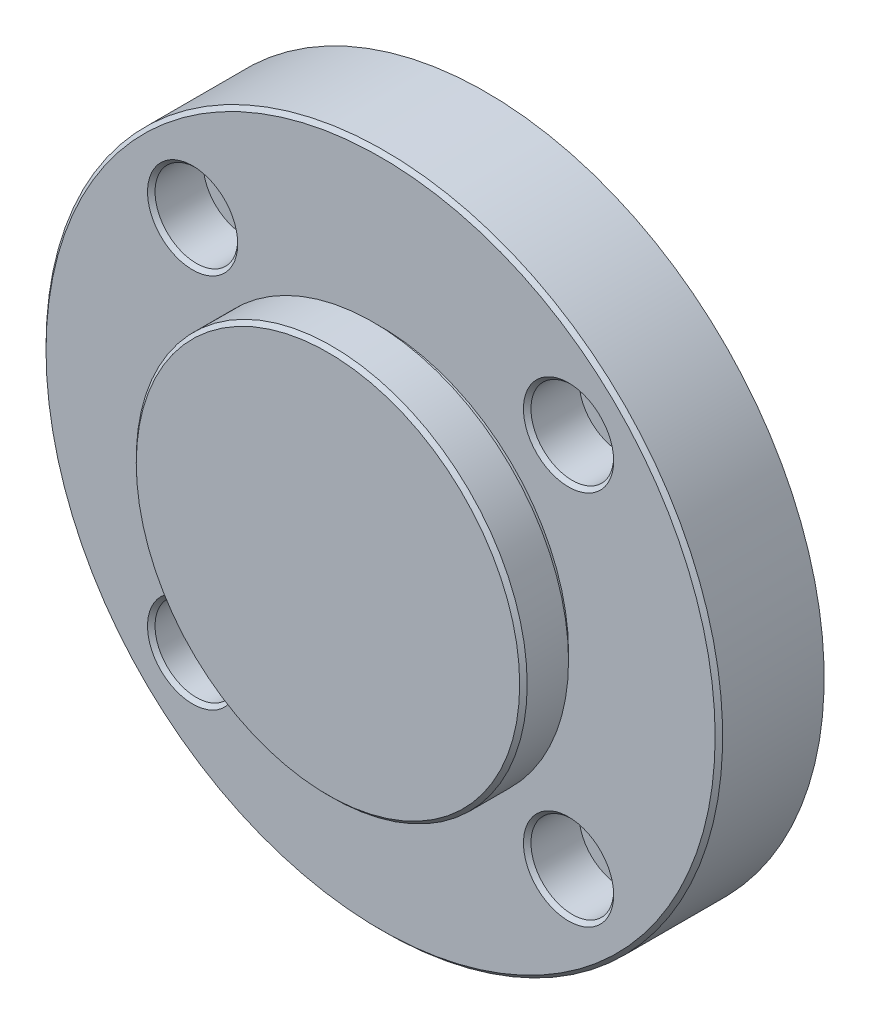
ISO-10303-21;
HEADER;
FILE_DESCRIPTION(('STEP AP214'),'2;1');
FILE_NAME('part.step','',(''),(''),'','','');
FILE_SCHEMA(('AUTOMOTIVE_DESIGN { 1 0 10303 214 1 1 1 1 }'));
ENDSEC;
DATA;
#1=APPLICATION_CONTEXT('core data for automotive mechanical design processes');
#2=APPLICATION_PROTOCOL_DEFINITION('international standard','automotive_design',2000,#1);
#3=PRODUCT_CONTEXT('',#1,'mechanical');
#4=PRODUCT('Part','Part','',(#3));
#5=PRODUCT_RELATED_PRODUCT_CATEGORY('part','',(#4));
#6=PRODUCT_DEFINITION_FORMATION('','',#4);
#7=PRODUCT_DEFINITION_CONTEXT('part definition',#1,'design');
#8=PRODUCT_DEFINITION('design','',#6,#7);
#9=PRODUCT_DEFINITION_SHAPE('','',#8);
#10=(LENGTH_UNIT() NAMED_UNIT(*) SI_UNIT(.MILLI.,.METRE.));
#11=(NAMED_UNIT(*) PLANE_ANGLE_UNIT() SI_UNIT($,.RADIAN.));
#12=(NAMED_UNIT(*) SI_UNIT($,.STERADIAN.) SOLID_ANGLE_UNIT());
#13=UNCERTAINTY_MEASURE_WITH_UNIT(LENGTH_MEASURE(1.E-05),#10,'distance_accuracy_value','');
#14=(GEOMETRIC_REPRESENTATION_CONTEXT(3) GLOBAL_UNCERTAINTY_ASSIGNED_CONTEXT((#13)) GLOBAL_UNIT_ASSIGNED_CONTEXT((#10,
#11,#12)) REPRESENTATION_CONTEXT('',''));
#15=CARTESIAN_POINT('',(0.,0.,0.));
#16=DIRECTION('',(0.,0.,1.));
#17=DIRECTION('',(1.,0.,0.));
#18=AXIS2_PLACEMENT_3D('',#15,#16,#17);
#19=CARTESIAN_POINT('',(0.,0.,21.));
#20=DIRECTION('',(0.,0.,-1.));
#21=DIRECTION('',(-1.,0.,0.));
#22=AXIS2_PLACEMENT_3D('',#19,#20,#21);
#23=CYLINDRICAL_SURFACE('',#22,45.);
#24=CARTESIAN_POINT('',(0.,0.,13.5000000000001));
#25=DIRECTION('',(0.,0.,1.));
#26=DIRECTION('',(1.,0.,0.));
#27=AXIS2_PLACEMENT_3D('',#24,#25,#26);
#28=CIRCLE('',#27,45.);
#29=CARTESIAN_POINT('',(-45.,0.,13.5000000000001));
#30=VERTEX_POINT('',#29);
#31=EDGE_CURVE('E45',#30,#30,#28,.F.);
#32=CARTESIAN_POINT('',(0.,0.,0.));
#33=DIRECTION('',(0.,0.,1.));
#34=DIRECTION('',(1.,0.,0.));
#35=AXIS2_PLACEMENT_3D('',#32,#33,#34);
#36=CIRCLE('',#35,45.);
#37=CARTESIAN_POINT('',(-45.,0.,0.));
#38=VERTEX_POINT('',#37);
#39=EDGE_CURVE('E53',#38,#38,#36,.T.);
#40=CARTESIAN_POINT('',(-45.,0.,13.5000000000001));
#41=CARTESIAN_POINT('',(-45.,0.,13.3593750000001));
#42=CARTESIAN_POINT('',(-45.,0.,13.2187500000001));
#43=CARTESIAN_POINT('',(-45.,0.,12.9375000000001));
#44=CARTESIAN_POINT('',(-45.,0.,12.7968750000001));
#45=CARTESIAN_POINT('',(-45.,0.,12.5156250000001));
#46=CARTESIAN_POINT('',(-45.,0.,12.3750000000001));
#47=CARTESIAN_POINT('',(-45.,0.,12.0937500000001));
#48=CARTESIAN_POINT('',(-45.,0.,11.9531250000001));
#49=CARTESIAN_POINT('',(-45.,0.,11.6718750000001));
#50=CARTESIAN_POINT('',(-45.,0.,11.5312500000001));
#51=CARTESIAN_POINT('',(-45.,0.,11.2500000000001));
#52=CARTESIAN_POINT('',(-45.,0.,11.1093750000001));
#53=CARTESIAN_POINT('',(-45.,0.,10.8281250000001));
#54=CARTESIAN_POINT('',(-45.,0.,10.6875000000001));
#55=CARTESIAN_POINT('',(-45.,0.,10.4062500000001));
#56=CARTESIAN_POINT('',(-45.,0.,10.2656250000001));
#57=CARTESIAN_POINT('',(-45.,0.,9.98437500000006));
#58=CARTESIAN_POINT('',(-45.,0.,9.84375000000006));
#59=CARTESIAN_POINT('',(-45.,0.,9.56250000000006));
#60=CARTESIAN_POINT('',(-45.,0.,9.42187500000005));
#61=CARTESIAN_POINT('',(-45.,0.,9.14062500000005));
#62=CARTESIAN_POINT('',(-45.,0.,9.00000000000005));
#63=CARTESIAN_POINT('',(-45.,0.,8.71875000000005));
#64=CARTESIAN_POINT('',(-45.,0.,8.57812500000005));
#65=CARTESIAN_POINT('',(-45.,0.,8.29687500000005));
#66=CARTESIAN_POINT('',(-45.,0.,8.15625000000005));
#67=CARTESIAN_POINT('',(-45.,0.,7.87500000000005));
#68=CARTESIAN_POINT('',(-45.,0.,7.73437500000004));
#69=CARTESIAN_POINT('',(-45.,0.,7.45312500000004));
#70=CARTESIAN_POINT('',(-45.,0.,7.31250000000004));
#71=CARTESIAN_POINT('',(-45.,0.,7.03125000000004));
#72=CARTESIAN_POINT('',(-45.,0.,6.89062500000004));
#73=CARTESIAN_POINT('',(-45.,0.,6.60937500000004));
#74=CARTESIAN_POINT('',(-45.,0.,6.46875000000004));
#75=CARTESIAN_POINT('',(-45.,0.,6.18750000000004));
#76=CARTESIAN_POINT('',(-45.,0.,6.04687500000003));
#77=CARTESIAN_POINT('',(-45.,0.,5.76562500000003));
#78=CARTESIAN_POINT('',(-45.,0.,5.62500000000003));
#79=CARTESIAN_POINT('',(-45.,0.,5.34375000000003));
#80=CARTESIAN_POINT('',(-45.,0.,5.20312500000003));
#81=CARTESIAN_POINT('',(-45.,0.,4.92187500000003));
#82=CARTESIAN_POINT('',(-45.,0.,4.78125000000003));
#83=CARTESIAN_POINT('',(-45.,0.,4.50000000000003));
#84=CARTESIAN_POINT('',(-45.,0.,4.35937500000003));
#85=CARTESIAN_POINT('',(-45.,0.,4.07812500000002));
#86=CARTESIAN_POINT('',(-45.,0.,3.93750000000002));
#87=CARTESIAN_POINT('',(-45.,0.,3.65625000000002));
#88=CARTESIAN_POINT('',(-45.,0.,3.51562500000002));
#89=CARTESIAN_POINT('',(-45.,0.,3.23437500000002));
#90=CARTESIAN_POINT('',(-45.,0.,3.09375000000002));
#91=CARTESIAN_POINT('',(-45.,0.,2.81250000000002));
#92=CARTESIAN_POINT('',(-45.,0.,2.67187500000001));
#93=CARTESIAN_POINT('',(-45.,0.,2.39062500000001));
#94=CARTESIAN_POINT('',(-45.,0.,2.25000000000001));
#95=CARTESIAN_POINT('',(-45.,0.,1.96875000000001));
#96=CARTESIAN_POINT('',(-45.,0.,1.82812500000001));
#97=CARTESIAN_POINT('',(-45.,0.,1.54687500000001));
#98=CARTESIAN_POINT('',(-45.,0.,1.40625000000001));
#99=CARTESIAN_POINT('',(-45.,0.,1.12500000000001));
#100=CARTESIAN_POINT('',(-45.,0.,0.984375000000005));
#101=CARTESIAN_POINT('',(-45.,0.,0.703125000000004));
#102=CARTESIAN_POINT('',(-45.,0.,0.562500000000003));
#103=CARTESIAN_POINT('',(-45.,0.,0.281250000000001));
#104=CARTESIAN_POINT('',(-45.,0.,0.140625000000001));
#105=CARTESIAN_POINT('',(-45.,0.,0.));
#106=B_SPLINE_CURVE_WITH_KNOTS('',3,(#40,#41,#42,#43,#44,#45,#46,#47,#48,#49,#50,#51,#52,#53,
#54,#55,#56,#57,#58,#59,#60,#61,#62,#63,#64,#65,#66,#67,#68,#69,#70,#71,#72,#73,#74,#75,#76,#77,
#78,#79,#80,#81,#82,#83,#84,#85,#86,#87,#88,#89,#90,#91,#92,#93,#94,#95,#96,#97,#98,#99,#100,
#101,#102,#103,#104,#105),.UNSPECIFIED.,.F.,.F.,(4,2,2,2,2,2,2,2,2,2,2,2,2,2,2,2,2,2,2,2,2,2,2,
2,2,2,2,2,2,2,2,2,4),(0.,0.421875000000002,0.843750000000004,1.26562500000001,1.68750000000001,
2.10937500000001,2.53125000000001,2.95312500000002,3.37500000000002,3.79687500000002,
4.21875000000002,4.64062500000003,5.06250000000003,5.48437500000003,5.90625000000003,
6.32812500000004,6.75000000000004,7.17187500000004,7.59375000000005,8.01562500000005,
8.43750000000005,8.85937500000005,9.28125000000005,9.70312500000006,10.1250000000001,
10.5468750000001,10.9687500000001,11.3906250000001,11.8125000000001,12.2343750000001,
12.6562500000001,13.0781250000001,13.5000000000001),.UNSPECIFIED.);
#107=EDGE_CURVE('BSEAM33',#30,#38,#106,.T.);
#108=ORIENTED_EDGE('',*,*,#31,.T.);
#109=ORIENTED_EDGE('',*,*,#39,.T.);
#110=ORIENTED_EDGE('',*,*,#107,.T.);
#111=ORIENTED_EDGE('',*,*,#107,.F.);
#112=EDGE_LOOP('',(#108,#110,#109,#111));
#113=FACE_BOUND('',#112,.T.);
#114=ADVANCED_FACE('F33',(#113),#23,.T.);
#115=CARTESIAN_POINT('',(0.,0.,0.));
#116=DIRECTION('',(0.,0.,1.));
#117=DIRECTION('',(1.,0.,0.));
#118=AXIS2_PLACEMENT_3D('',#115,#116,#117);
#119=PLANE('',#118);
#120=CARTESIAN_POINT('',(-25.,25.,0.));
#121=DIRECTION('',(0.,0.,1.));
#122=DIRECTION('',(1.,0.,0.));
#123=AXIS2_PLACEMENT_3D('',#120,#121,#122);
#124=CIRCLE('',#123,3.30000000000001);
#125=CARTESIAN_POINT('',(-21.7,25.,0.));
#126=VERTEX_POINT('',#125);
#127=EDGE_CURVE('E107',#126,#126,#124,.T.);
#128=ORIENTED_EDGE('',*,*,#127,.T.);
#129=EDGE_LOOP('',(#128));
#130=FACE_BOUND('',#129,.T.);
#131=CARTESIAN_POINT('',(25.,25.,0.));
#132=DIRECTION('',(0.,0.,1.));
#133=DIRECTION('',(1.,0.,0.));
#134=AXIS2_PLACEMENT_3D('',#131,#132,#133);
#135=CIRCLE('',#134,3.30000000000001);
#136=CARTESIAN_POINT('',(28.3,25.,0.));
#137=VERTEX_POINT('',#136);
#138=EDGE_CURVE('E92',#137,#137,#135,.T.);
#139=ORIENTED_EDGE('',*,*,#138,.T.);
#140=EDGE_LOOP('',(#139));
#141=FACE_BOUND('',#140,.T.);
#142=CARTESIAN_POINT('',(25.,-25.,0.));
#143=DIRECTION('',(0.,0.,1.));
#144=DIRECTION('',(1.,0.,0.));
#145=AXIS2_PLACEMENT_3D('',#142,#143,#144);
#146=CIRCLE('',#145,3.30000000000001);
#147=CARTESIAN_POINT('',(28.3,-25.,0.));
#148=VERTEX_POINT('',#147);
#149=EDGE_CURVE('E77',#148,#148,#146,.T.);
#150=ORIENTED_EDGE('',*,*,#149,.T.);
#151=EDGE_LOOP('',(#150));
#152=FACE_BOUND('',#151,.T.);
#153=CARTESIAN_POINT('',(-25.,-25.,0.));
#154=DIRECTION('',(0.,0.,1.));
#155=DIRECTION('',(1.,0.,0.));
#156=AXIS2_PLACEMENT_3D('',#153,#154,#155);
#157=CIRCLE('',#156,3.30000000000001);
#158=CARTESIAN_POINT('',(-21.7,-25.,0.));
#159=VERTEX_POINT('',#158);
#160=EDGE_CURVE('E60',#159,#159,#157,.T.);
#161=ORIENTED_EDGE('',*,*,#160,.T.);
#162=EDGE_LOOP('',(#161));
#163=FACE_BOUND('',#162,.T.);
#164=ORIENTED_EDGE('',*,*,#39,.F.);
#165=EDGE_LOOP('',(#164));
#166=FACE_BOUND('',#165,.T.);
#167=ADVANCED_FACE('F129',(#130,#141,#152,#163,#166),#119,.F.);
#168=CARTESIAN_POINT('',(0.,0.,14.));
#169=DIRECTION('',(0.,0.,1.));
#170=DIRECTION('',(1.,0.,0.));
#171=AXIS2_PLACEMENT_3D('',#168,#169,#170);
#172=PLANE('',#171);
#173=CARTESIAN_POINT('',(-25.,25.,14.));
#174=DIRECTION('',(0.,0.,1.));
#175=DIRECTION('',(1.,0.,0.));
#176=AXIS2_PLACEMENT_3D('',#173,#174,#175);
#177=CIRCLE('',#176,6.);
#178=CARTESIAN_POINT('',(-19.,25.,14.));
#179=VERTEX_POINT('',#178);
#180=EDGE_CURVE('E119',#179,#179,#177,.T.);
#181=ORIENTED_EDGE('',*,*,#180,.F.);
#182=EDGE_LOOP('',(#181));
#183=FACE_BOUND('',#182,.T.);
#184=CARTESIAN_POINT('',(25.,25.,14.));
#185=DIRECTION('',(0.,0.,1.));
#186=DIRECTION('',(1.,0.,0.));
#187=AXIS2_PLACEMENT_3D('',#184,#185,#186);
#188=CIRCLE('',#187,6.);
#189=CARTESIAN_POINT('',(31.,25.,14.));
#190=VERTEX_POINT('',#189);
#191=EDGE_CURVE('E104',#190,#190,#188,.T.);
#192=ORIENTED_EDGE('',*,*,#191,.F.);
#193=EDGE_LOOP('',(#192));
#194=FACE_BOUND('',#193,.T.);
#195=CARTESIAN_POINT('',(25.,-25.,14.));
#196=DIRECTION('',(0.,0.,1.));
#197=DIRECTION('',(1.,0.,0.));
#198=AXIS2_PLACEMENT_3D('',#195,#196,#197);
#199=CIRCLE('',#198,6.);
#200=CARTESIAN_POINT('',(31.,-25.,14.));
#201=VERTEX_POINT('',#200);
#202=EDGE_CURVE('E89',#201,#201,#199,.T.);
#203=ORIENTED_EDGE('',*,*,#202,.F.);
#204=EDGE_LOOP('',(#203));
#205=FACE_BOUND('',#204,.T.);
#206=CARTESIAN_POINT('',(-25.,-25.,14.));
#207=DIRECTION('',(0.,0.,1.));
#208=DIRECTION('',(1.,0.,0.));
#209=AXIS2_PLACEMENT_3D('',#206,#207,#208);
#210=CIRCLE('',#209,6.);
#211=CARTESIAN_POINT('',(-19.,-25.,14.));
#212=VERTEX_POINT('',#211);
#213=EDGE_CURVE('E74',#212,#212,#210,.T.);
#214=ORIENTED_EDGE('',*,*,#213,.F.);
#215=EDGE_LOOP('',(#214));
#216=FACE_BOUND('',#215,.T.);
#217=CARTESIAN_POINT('',(0.,0.,14.));
#218=DIRECTION('',(0.,0.,1.));
#219=DIRECTION('',(1.,0.,0.));
#220=AXIS2_PLACEMENT_3D('',#217,#218,#219);
#221=CIRCLE('',#220,44.5000000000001);
#222=CARTESIAN_POINT('',(44.5000000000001,0.,14.));
#223=VERTEX_POINT('',#222);
#224=EDGE_CURVE('E50',#223,#223,#221,.T.);
#225=ORIENTED_EDGE('',*,*,#224,.T.);
#226=EDGE_LOOP('',(#225));
#227=FACE_BOUND('',#226,.T.);
#228=CARTESIAN_POINT('',(0.,0.,14.));
#229=DIRECTION('',(0.,0.,1.));
#230=DIRECTION('',(1.,0.,0.));
#231=AXIS2_PLACEMENT_3D('',#228,#229,#230);
#232=CIRCLE('',#231,25.);
#233=CARTESIAN_POINT('',(25.,0.,14.));
#234=VERTEX_POINT('',#233);
#235=EDGE_CURVE('E56',#234,#234,#232,.T.);
#236=ORIENTED_EDGE('',*,*,#235,.F.);
#237=EDGE_LOOP('',(#236));
#238=FACE_BOUND('',#237,.T.);
#239=ADVANCED_FACE('F125',(#183,#194,#205,#216,#227,#238),#172,.T.);
#240=CARTESIAN_POINT('',(0.,0.,14.));
#241=DIRECTION('',(0.,0.,-1.));
#242=DIRECTION('',(-1.,0.,0.));
#243=AXIS2_PLACEMENT_3D('',#240,#241,#242);
#244=CONICAL_SURFACE('',#243,44.5000000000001,0.785398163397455);
#245=ORIENTED_EDGE('',*,*,#31,.F.);
#246=EDGE_LOOP('',(#245));
#247=FACE_BOUND('',#246,.T.);
#248=ORIENTED_EDGE('',*,*,#224,.F.);
#249=EDGE_LOOP('',(#248));
#250=FACE_BOUND('',#249,.T.);
#251=ADVANCED_FACE('F128',(#247,#250),#244,.T.);
#252=CARTESIAN_POINT('',(0.,0.,15.));
#253=DIRECTION('',(0.,0.,1.));
#254=DIRECTION('',(1.,0.,0.));
#255=AXIS2_PLACEMENT_3D('',#252,#253,#254);
#256=PLANE('',#255);
#257=CARTESIAN_POINT('',(0.,0.,15.));
#258=DIRECTION('',(0.,0.,1.));
#259=DIRECTION('',(1.,0.,0.));
#260=AXIS2_PLACEMENT_3D('',#257,#258,#259);
#261=CIRCLE('',#260,26.);
#262=CARTESIAN_POINT('',(26.,0.,15.));
#263=VERTEX_POINT('',#262);
#264=EDGE_CURVE('E37',#263,#263,#261,.F.);
#265=ORIENTED_EDGE('',*,*,#264,.T.);
#266=EDGE_LOOP('',(#265));
#267=FACE_BOUND('',#266,.T.);
#268=CARTESIAN_POINT('',(0.,0.,15.));
#269=DIRECTION('',(0.,0.,1.));
#270=DIRECTION('',(1.,0.,0.));
#271=AXIS2_PLACEMENT_3D('',#268,#269,#270);
#272=CIRCLE('',#271,25.);
#273=CARTESIAN_POINT('',(25.,0.,15.));
#274=VERTEX_POINT('',#273);
#275=EDGE_CURVE('E59',#274,#274,#272,.T.);
#276=ORIENTED_EDGE('',*,*,#275,.T.);
#277=EDGE_LOOP('',(#276));
#278=FACE_BOUND('',#277,.T.);
#279=ADVANCED_FACE('F144',(#267,#278),#256,.F.);
#280=CARTESIAN_POINT('',(0.,0.,15.));
#281=DIRECTION('',(0.,0.,-1.));
#282=DIRECTION('',(-1.,0.,0.));
#283=AXIS2_PLACEMENT_3D('',#280,#281,#282);
#284=CYLINDRICAL_SURFACE('',#283,25.);
#285=ORIENTED_EDGE('',*,*,#275,.F.);
#286=EDGE_LOOP('',(#285));
#287=FACE_BOUND('',#286,.T.);
#288=ORIENTED_EDGE('',*,*,#235,.T.);
#289=EDGE_LOOP('',(#288));
#290=FACE_BOUND('',#289,.T.);
#291=ADVANCED_FACE('F141',(#287,#290),#284,.T.);
#292=CARTESIAN_POINT('',(0.,0.,21.));
#293=DIRECTION('',(0.,0.,1.));
#294=DIRECTION('',(1.,0.,0.));
#295=AXIS2_PLACEMENT_3D('',#292,#293,#294);
#296=PLANE('',#295);
#297=CARTESIAN_POINT('',(0.,0.,21.));
#298=DIRECTION('',(0.,0.,1.));
#299=DIRECTION('',(1.,0.,0.));
#300=AXIS2_PLACEMENT_3D('',#297,#298,#299);
#301=CIRCLE('',#300,25.5);
#302=CARTESIAN_POINT('',(25.5,0.,21.));
#303=VERTEX_POINT('',#302);
#304=EDGE_CURVE('E41',#303,#303,#301,.T.);
#305=ORIENTED_EDGE('',*,*,#304,.T.);
#306=EDGE_LOOP('',(#305));
#307=FACE_BOUND('',#306,.T.);
#308=ADVANCED_FACE('F143',(#307),#296,.T.);
#309=CARTESIAN_POINT('',(0.,0.,21.));
#310=DIRECTION('',(0.,0.,-1.));
#311=DIRECTION('',(-1.,0.,0.));
#312=AXIS2_PLACEMENT_3D('',#309,#310,#311);
#313=CONICAL_SURFACE('',#312,25.5,0.785398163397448);
#314=CARTESIAN_POINT('',(0.,0.,20.5));
#315=DIRECTION('',(0.,0.,1.));
#316=DIRECTION('',(1.,0.,0.));
#317=AXIS2_PLACEMENT_3D('',#314,#315,#316);
#318=CIRCLE('',#317,26.);
#319=CARTESIAN_POINT('',(26.,0.,20.5));
#320=VERTEX_POINT('',#319);
#321=EDGE_CURVE('E11',#320,#320,#318,.F.);
#322=ORIENTED_EDGE('',*,*,#321,.F.);
#323=EDGE_LOOP('',(#322));
#324=FACE_BOUND('',#323,.T.);
#325=ORIENTED_EDGE('',*,*,#304,.F.);
#326=EDGE_LOOP('',(#325));
#327=FACE_BOUND('',#326,.T.);
#328=ADVANCED_FACE('F35',(#324,#327),#313,.T.);
#329=CARTESIAN_POINT('',(0.,0.,14.));
#330=DIRECTION('',(0.,0.,1.));
#331=DIRECTION('',(1.,0.,0.));
#332=AXIS2_PLACEMENT_3D('',#329,#330,#331);
#333=CYLINDRICAL_SURFACE('',#332,26.);
#334=ORIENTED_EDGE('',*,*,#264,.F.);
#335=EDGE_LOOP('',(#334));
#336=FACE_BOUND('',#335,.T.);
#337=ORIENTED_EDGE('',*,*,#321,.T.);
#338=EDGE_LOOP('',(#337));
#339=FACE_BOUND('',#338,.T.);
#340=ADVANCED_FACE('F194',(#336,#339),#333,.T.);
#341=CARTESIAN_POINT('',(-25.,-25.,14.));
#342=DIRECTION('',(0.,0.,1.));
#343=DIRECTION('',(1.,0.,0.));
#344=AXIS2_PLACEMENT_3D('',#341,#342,#343);
#345=CYLINDRICAL_SURFACE('',#344,3.3);
#346=ORIENTED_EDGE('',*,*,#160,.F.);
#347=EDGE_LOOP('',(#346));
#348=FACE_BOUND('',#347,.T.);
#349=CARTESIAN_POINT('',(-25.,-25.,7.1));
#350=DIRECTION('',(0.,0.,1.));
#351=DIRECTION('',(1.,0.,0.));
#352=AXIS2_PLACEMENT_3D('',#349,#350,#351);
#353=CIRCLE('',#352,3.3);
#354=CARTESIAN_POINT('',(-21.7,-25.,7.1));
#355=VERTEX_POINT('',#354);
#356=EDGE_CURVE('E65',#355,#355,#353,.T.);
#357=ORIENTED_EDGE('',*,*,#356,.T.);
#358=EDGE_LOOP('',(#357));
#359=FACE_BOUND('',#358,.T.);
#360=ADVANCED_FACE('F199',(#348,#359),#345,.F.);
#361=CARTESIAN_POINT('',(-19.5,-25.,7.1));
#362=DIRECTION('',(0.,0.,-1.));
#363=DIRECTION('',(-1.,0.,0.));
#364=AXIS2_PLACEMENT_3D('',#361,#362,#363);
#365=PLANE('',#364);
#366=ORIENTED_EDGE('',*,*,#356,.F.);
#367=EDGE_LOOP('',(#366));
#368=FACE_BOUND('',#367,.T.);
#369=CARTESIAN_POINT('',(-25.,-25.,7.1));
#370=DIRECTION('',(0.,0.,1.));
#371=DIRECTION('',(1.,0.,0.));
#372=AXIS2_PLACEMENT_3D('',#369,#370,#371);
#373=CIRCLE('',#372,5.5);
#374=CARTESIAN_POINT('',(-19.5,-25.,7.1));
#375=VERTEX_POINT('',#374);
#376=EDGE_CURVE('E68',#375,#375,#373,.T.);
#377=ORIENTED_EDGE('',*,*,#376,.T.);
#378=EDGE_LOOP('',(#377));
#379=FACE_BOUND('',#378,.T.);
#380=ADVANCED_FACE('F219',(#368,#379),#365,.F.);
#381=CARTESIAN_POINT('',(-25.,-25.,14.));
#382=DIRECTION('',(0.,0.,1.));
#383=DIRECTION('',(1.,0.,0.));
#384=AXIS2_PLACEMENT_3D('',#381,#382,#383);
#385=CYLINDRICAL_SURFACE('',#384,5.5);
#386=ORIENTED_EDGE('',*,*,#376,.F.);
#387=EDGE_LOOP('',(#386));
#388=FACE_BOUND('',#387,.T.);
#389=CARTESIAN_POINT('',(-25.,-25.,13.5));
#390=DIRECTION('',(0.,0.,1.));
#391=DIRECTION('',(1.,0.,0.));
#392=AXIS2_PLACEMENT_3D('',#389,#390,#391);
#393=CIRCLE('',#392,5.5);
#394=CARTESIAN_POINT('',(-19.5,-25.,13.5));
#395=VERTEX_POINT('',#394);
#396=EDGE_CURVE('E71',#395,#395,#393,.T.);
#397=ORIENTED_EDGE('',*,*,#396,.T.);
#398=EDGE_LOOP('',(#397));
#399=FACE_BOUND('',#398,.T.);
#400=ADVANCED_FACE('F228',(#388,#399),#385,.F.);
#401=CARTESIAN_POINT('',(-25.,-25.,14.));
#402=DIRECTION('',(0.,0.,1.));
#403=DIRECTION('',(1.,0.,0.));
#404=AXIS2_PLACEMENT_3D('',#401,#402,#403);
#405=CONICAL_SURFACE('',#404,6.,0.78539816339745);
#406=ORIENTED_EDGE('',*,*,#396,.F.);
#407=EDGE_LOOP('',(#406));
#408=FACE_BOUND('',#407,.T.);
#409=ORIENTED_EDGE('',*,*,#213,.T.);
#410=EDGE_LOOP('',(#409));
#411=FACE_BOUND('',#410,.T.);
#412=ADVANCED_FACE('F238',(#408,#411),#405,.F.);
#413=CARTESIAN_POINT('',(25.,-25.,14.));
#414=DIRECTION('',(0.,0.,1.));
#415=DIRECTION('',(1.,0.,0.));
#416=AXIS2_PLACEMENT_3D('',#413,#414,#415);
#417=CYLINDRICAL_SURFACE('',#416,3.3);
#418=ORIENTED_EDGE('',*,*,#149,.F.);
#419=EDGE_LOOP('',(#418));
#420=FACE_BOUND('',#419,.T.);
#421=CARTESIAN_POINT('',(25.,-25.,7.1));
#422=DIRECTION('',(0.,0.,1.));
#423=DIRECTION('',(1.,0.,0.));
#424=AXIS2_PLACEMENT_3D('',#421,#422,#423);
#425=CIRCLE('',#424,3.3);
#426=CARTESIAN_POINT('',(28.3,-25.,7.1));
#427=VERTEX_POINT('',#426);
#428=EDGE_CURVE('E80',#427,#427,#425,.T.);
#429=ORIENTED_EDGE('',*,*,#428,.T.);
#430=EDGE_LOOP('',(#429));
#431=FACE_BOUND('',#430,.T.);
#432=ADVANCED_FACE('F248',(#420,#431),#417,.F.);
#433=CARTESIAN_POINT('',(30.5,-25.,7.1));
#434=DIRECTION('',(0.,0.,-1.));
#435=DIRECTION('',(-1.,0.,0.));
#436=AXIS2_PLACEMENT_3D('',#433,#434,#435);
#437=PLANE('',#436);
#438=ORIENTED_EDGE('',*,*,#428,.F.);
#439=EDGE_LOOP('',(#438));
#440=FACE_BOUND('',#439,.T.);
#441=CARTESIAN_POINT('',(25.,-25.,7.1));
#442=DIRECTION('',(0.,0.,1.));
#443=DIRECTION('',(1.,0.,0.));
#444=AXIS2_PLACEMENT_3D('',#441,#442,#443);
#445=CIRCLE('',#444,5.5);
#446=CARTESIAN_POINT('',(30.5,-25.,7.1));
#447=VERTEX_POINT('',#446);
#448=EDGE_CURVE('E83',#447,#447,#445,.T.);
#449=ORIENTED_EDGE('',*,*,#448,.T.);
#450=EDGE_LOOP('',(#449));
#451=FACE_BOUND('',#450,.T.);
#452=ADVANCED_FACE('F258',(#440,#451),#437,.F.);
#453=CARTESIAN_POINT('',(25.,-25.,14.));
#454=DIRECTION('',(0.,0.,1.));
#455=DIRECTION('',(1.,0.,0.));
#456=AXIS2_PLACEMENT_3D('',#453,#454,#455);
#457=CYLINDRICAL_SURFACE('',#456,5.5);
#458=ORIENTED_EDGE('',*,*,#448,.F.);
#459=EDGE_LOOP('',(#458));
#460=FACE_BOUND('',#459,.T.);
#461=CARTESIAN_POINT('',(25.,-25.,13.5));
#462=DIRECTION('',(0.,0.,1.));
#463=DIRECTION('',(1.,0.,0.));
#464=AXIS2_PLACEMENT_3D('',#461,#462,#463);
#465=CIRCLE('',#464,5.5);
#466=CARTESIAN_POINT('',(30.5,-25.,13.5));
#467=VERTEX_POINT('',#466);
#468=EDGE_CURVE('E86',#467,#467,#465,.T.);
#469=ORIENTED_EDGE('',*,*,#468,.T.);
#470=EDGE_LOOP('',(#469));
#471=FACE_BOUND('',#470,.T.);
#472=ADVANCED_FACE('F268',(#460,#471),#457,.F.);
#473=CARTESIAN_POINT('',(25.,-25.,14.));
#474=DIRECTION('',(0.,0.,1.));
#475=DIRECTION('',(1.,0.,0.));
#476=AXIS2_PLACEMENT_3D('',#473,#474,#475);
#477=CONICAL_SURFACE('',#476,6.,0.78539816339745);
#478=ORIENTED_EDGE('',*,*,#468,.F.);
#479=EDGE_LOOP('',(#478));
#480=FACE_BOUND('',#479,.T.);
#481=ORIENTED_EDGE('',*,*,#202,.T.);
#482=EDGE_LOOP('',(#481));
#483=FACE_BOUND('',#482,.T.);
#484=ADVANCED_FACE('F278',(#480,#483),#477,.F.);
#485=CARTESIAN_POINT('',(25.,25.,14.));
#486=DIRECTION('',(0.,0.,1.));
#487=DIRECTION('',(1.,0.,0.));
#488=AXIS2_PLACEMENT_3D('',#485,#486,#487);
#489=CYLINDRICAL_SURFACE('',#488,3.3);
#490=ORIENTED_EDGE('',*,*,#138,.F.);
#491=EDGE_LOOP('',(#490));
#492=FACE_BOUND('',#491,.T.);
#493=CARTESIAN_POINT('',(25.,25.,7.1));
#494=DIRECTION('',(0.,0.,1.));
#495=DIRECTION('',(1.,0.,0.));
#496=AXIS2_PLACEMENT_3D('',#493,#494,#495);
#497=CIRCLE('',#496,3.3);
#498=CARTESIAN_POINT('',(28.3,25.,7.1));
#499=VERTEX_POINT('',#498);
#500=EDGE_CURVE('E95',#499,#499,#497,.T.);
#501=ORIENTED_EDGE('',*,*,#500,.T.);
#502=EDGE_LOOP('',(#501));
#503=FACE_BOUND('',#502,.T.);
#504=ADVANCED_FACE('F288',(#492,#503),#489,.F.);
#505=CARTESIAN_POINT('',(30.5,25.,7.1));
#506=DIRECTION('',(0.,0.,-1.));
#507=DIRECTION('',(-1.,0.,0.));
#508=AXIS2_PLACEMENT_3D('',#505,#506,#507);
#509=PLANE('',#508);
#510=ORIENTED_EDGE('',*,*,#500,.F.);
#511=EDGE_LOOP('',(#510));
#512=FACE_BOUND('',#511,.T.);
#513=CARTESIAN_POINT('',(25.,25.,7.1));
#514=DIRECTION('',(0.,0.,1.));
#515=DIRECTION('',(1.,0.,0.));
#516=AXIS2_PLACEMENT_3D('',#513,#514,#515);
#517=CIRCLE('',#516,5.5);
#518=CARTESIAN_POINT('',(30.5,25.,7.1));
#519=VERTEX_POINT('',#518);
#520=EDGE_CURVE('E98',#519,#519,#517,.T.);
#521=ORIENTED_EDGE('',*,*,#520,.T.);
#522=EDGE_LOOP('',(#521));
#523=FACE_BOUND('',#522,.T.);
#524=ADVANCED_FACE('F298',(#512,#523),#509,.F.);
#525=CARTESIAN_POINT('',(25.,25.,14.));
#526=DIRECTION('',(0.,0.,1.));
#527=DIRECTION('',(1.,0.,0.));
#528=AXIS2_PLACEMENT_3D('',#525,#526,#527);
#529=CYLINDRICAL_SURFACE('',#528,5.5);
#530=ORIENTED_EDGE('',*,*,#520,.F.);
#531=EDGE_LOOP('',(#530));
#532=FACE_BOUND('',#531,.T.);
#533=CARTESIAN_POINT('',(25.,25.,13.5));
#534=DIRECTION('',(0.,0.,1.));
#535=DIRECTION('',(1.,0.,0.));
#536=AXIS2_PLACEMENT_3D('',#533,#534,#535);
#537=CIRCLE('',#536,5.5);
#538=CARTESIAN_POINT('',(30.5,25.,13.5));
#539=VERTEX_POINT('',#538);
#540=EDGE_CURVE('E101',#539,#539,#537,.T.);
#541=ORIENTED_EDGE('',*,*,#540,.T.);
#542=EDGE_LOOP('',(#541));
#543=FACE_BOUND('',#542,.T.);
#544=ADVANCED_FACE('F308',(#532,#543),#529,.F.);
#545=CARTESIAN_POINT('',(25.,25.,14.));
#546=DIRECTION('',(0.,0.,1.));
#547=DIRECTION('',(1.,0.,0.));
#548=AXIS2_PLACEMENT_3D('',#545,#546,#547);
#549=CONICAL_SURFACE('',#548,6.,0.785398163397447);
#550=ORIENTED_EDGE('',*,*,#540,.F.);
#551=EDGE_LOOP('',(#550));
#552=FACE_BOUND('',#551,.T.);
#553=ORIENTED_EDGE('',*,*,#191,.T.);
#554=EDGE_LOOP('',(#553));
#555=FACE_BOUND('',#554,.T.);
#556=ADVANCED_FACE('F318',(#552,#555),#549,.F.);
#557=CARTESIAN_POINT('',(-25.,25.,14.));
#558=DIRECTION('',(0.,0.,1.));
#559=DIRECTION('',(1.,0.,0.));
#560=AXIS2_PLACEMENT_3D('',#557,#558,#559);
#561=CYLINDRICAL_SURFACE('',#560,3.3);
#562=ORIENTED_EDGE('',*,*,#127,.F.);
#563=EDGE_LOOP('',(#562));
#564=FACE_BOUND('',#563,.T.);
#565=CARTESIAN_POINT('',(-25.,25.,7.1));
#566=DIRECTION('',(0.,0.,1.));
#567=DIRECTION('',(1.,0.,0.));
#568=AXIS2_PLACEMENT_3D('',#565,#566,#567);
#569=CIRCLE('',#568,3.3);
#570=CARTESIAN_POINT('',(-21.7,25.,7.1));
#571=VERTEX_POINT('',#570);
#572=EDGE_CURVE('E110',#571,#571,#569,.T.);
#573=ORIENTED_EDGE('',*,*,#572,.T.);
#574=EDGE_LOOP('',(#573));
#575=FACE_BOUND('',#574,.T.);
#576=ADVANCED_FACE('F328',(#564,#575),#561,.F.);
#577=CARTESIAN_POINT('',(-19.5,25.,7.1));
#578=DIRECTION('',(0.,0.,-1.));
#579=DIRECTION('',(-1.,0.,0.));
#580=AXIS2_PLACEMENT_3D('',#577,#578,#579);
#581=PLANE('',#580);
#582=ORIENTED_EDGE('',*,*,#572,.F.);
#583=EDGE_LOOP('',(#582));
#584=FACE_BOUND('',#583,.T.);
#585=CARTESIAN_POINT('',(-25.,25.,7.1));
#586=DIRECTION('',(0.,0.,1.));
#587=DIRECTION('',(1.,0.,0.));
#588=AXIS2_PLACEMENT_3D('',#585,#586,#587);
#589=CIRCLE('',#588,5.5);
#590=CARTESIAN_POINT('',(-19.5,25.,7.1));
#591=VERTEX_POINT('',#590);
#592=EDGE_CURVE('E113',#591,#591,#589,.T.);
#593=ORIENTED_EDGE('',*,*,#592,.T.);
#594=EDGE_LOOP('',(#593));
#595=FACE_BOUND('',#594,.T.);
#596=ADVANCED_FACE('F338',(#584,#595),#581,.F.);
#597=CARTESIAN_POINT('',(-25.,25.,14.));
#598=DIRECTION('',(0.,0.,1.));
#599=DIRECTION('',(1.,0.,0.));
#600=AXIS2_PLACEMENT_3D('',#597,#598,#599);
#601=CYLINDRICAL_SURFACE('',#600,5.5);
#602=ORIENTED_EDGE('',*,*,#592,.F.);
#603=EDGE_LOOP('',(#602));
#604=FACE_BOUND('',#603,.T.);
#605=CARTESIAN_POINT('',(-25.,25.,13.5));
#606=DIRECTION('',(0.,0.,1.));
#607=DIRECTION('',(1.,0.,0.));
#608=AXIS2_PLACEMENT_3D('',#605,#606,#607);
#609=CIRCLE('',#608,5.5);
#610=CARTESIAN_POINT('',(-19.5,25.,13.5));
#611=VERTEX_POINT('',#610);
#612=EDGE_CURVE('E116',#611,#611,#609,.T.);
#613=ORIENTED_EDGE('',*,*,#612,.T.);
#614=EDGE_LOOP('',(#613));
#615=FACE_BOUND('',#614,.T.);
#616=ADVANCED_FACE('F348',(#604,#615),#601,.F.);
#617=CARTESIAN_POINT('',(-25.,25.,14.));
#618=DIRECTION('',(0.,0.,1.));
#619=DIRECTION('',(1.,0.,0.));
#620=AXIS2_PLACEMENT_3D('',#617,#618,#619);
#621=CONICAL_SURFACE('',#620,6.,0.78539816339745);
#622=ORIENTED_EDGE('',*,*,#612,.F.);
#623=EDGE_LOOP('',(#622));
#624=FACE_BOUND('',#623,.T.);
#625=ORIENTED_EDGE('',*,*,#180,.T.);
#626=EDGE_LOOP('',(#625));
#627=FACE_BOUND('',#626,.T.);
#628=ADVANCED_FACE('F123',(#624,#627),#621,.F.);
#629=CLOSED_SHELL('',(#114,#167,#239,#251,#279,#291,#308,#328,#340,#360,#380,#400,#412,#432,
#452,#472,#484,#504,#524,#544,#556,#576,#596,#616,#628));
#630=MANIFOLD_SOLID_BREP('B2',#629);
#631=ADVANCED_BREP_SHAPE_REPRESENTATION('',(#18,#630),#14);
#632=SHAPE_DEFINITION_REPRESENTATION(#9,#631);
ENDSEC;
END-ISO-10303-21;
